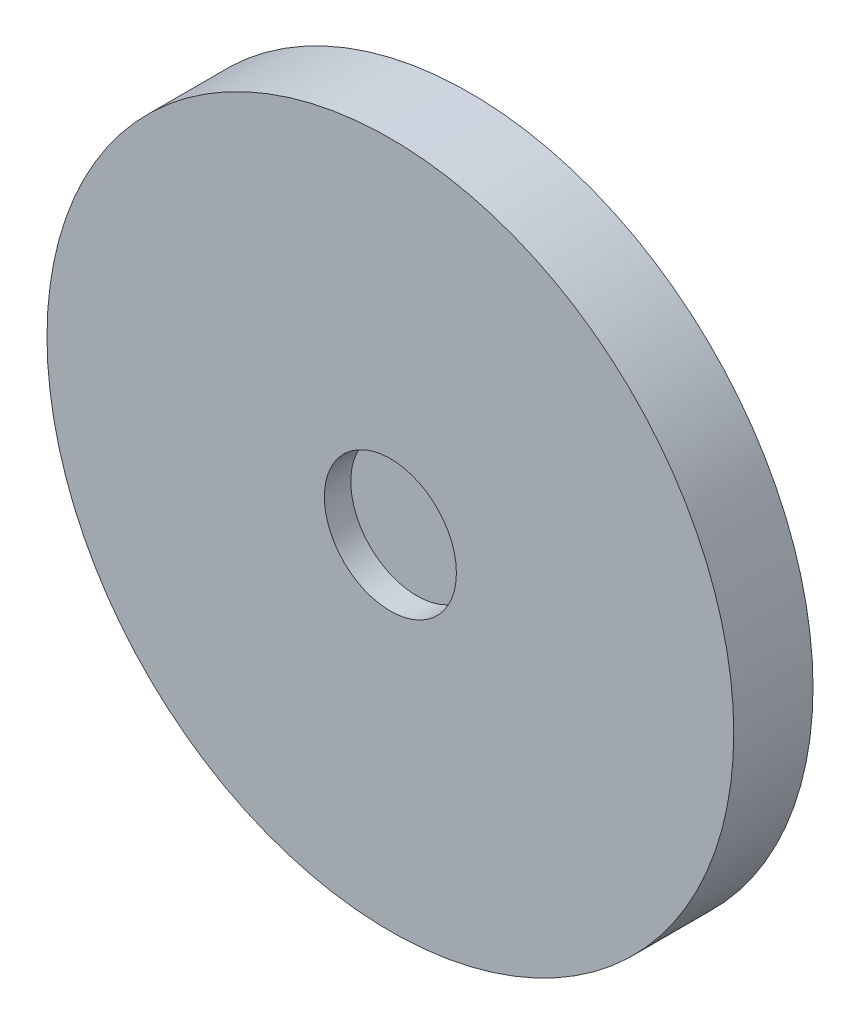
from build123d import *

# Parameters (mm, degrees)
SKETCH1_R           = 3.9
BOSS_EXTRUDE1_DEPTH = 0.9
SKETCH2_R           = 0.75
CUT_EXTRUDE1_DEPTH  = 0.3


with BuildPart() as part:
    # Sketch1 → Boss-Extrude1 (new body)
    with BuildSketch(Plane.XY):
        Circle(SKETCH1_R)
    extrude(amount=BOSS_EXTRUDE1_DEPTH)

    # Sketch2 → Cut-Extrude1 (cut)
    with BuildSketch(Plane.XY.offset(0.9)):
        Circle(SKETCH2_R)
    extrude(amount=-CUT_EXTRUDE1_DEPTH, mode=Mode.SUBTRACT)


solid = part.part
